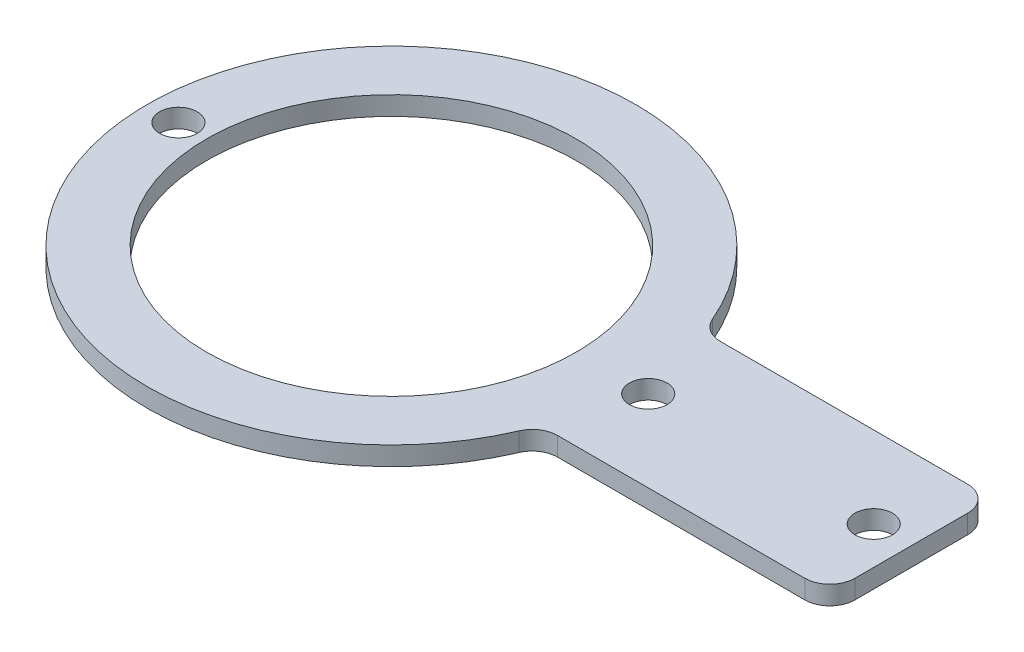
ISO-10303-21;
HEADER;
FILE_DESCRIPTION(('STEP AP214'),'2;1');
FILE_NAME('part.step','',(''),(''),'','','');
FILE_SCHEMA(('AUTOMOTIVE_DESIGN { 1 0 10303 214 1 1 1 1 }'));
ENDSEC;
DATA;
#1=APPLICATION_CONTEXT('core data for automotive mechanical design processes');
#2=APPLICATION_PROTOCOL_DEFINITION('international standard','automotive_design',2000,#1);
#3=PRODUCT_CONTEXT('',#1,'mechanical');
#4=PRODUCT('Part','Part','',(#3));
#5=PRODUCT_RELATED_PRODUCT_CATEGORY('part','',(#4));
#6=PRODUCT_DEFINITION_FORMATION('','',#4);
#7=PRODUCT_DEFINITION_CONTEXT('part definition',#1,'design');
#8=PRODUCT_DEFINITION('design','',#6,#7);
#9=PRODUCT_DEFINITION_SHAPE('','',#8);
#10=(LENGTH_UNIT() NAMED_UNIT(*) SI_UNIT(.MILLI.,.METRE.));
#11=(NAMED_UNIT(*) PLANE_ANGLE_UNIT() SI_UNIT($,.RADIAN.));
#12=(NAMED_UNIT(*) SI_UNIT($,.STERADIAN.) SOLID_ANGLE_UNIT());
#13=UNCERTAINTY_MEASURE_WITH_UNIT(LENGTH_MEASURE(1.E-05),#10,'distance_accuracy_value','');
#14=(GEOMETRIC_REPRESENTATION_CONTEXT(3) GLOBAL_UNCERTAINTY_ASSIGNED_CONTEXT((#13)) GLOBAL_UNIT_ASSIGNED_CONTEXT((#10,
#11,#12)) REPRESENTATION_CONTEXT('',''));
#15=CARTESIAN_POINT('',(0.,0.,0.));
#16=DIRECTION('',(0.,0.,1.));
#17=DIRECTION('',(1.,0.,0.));
#18=AXIS2_PLACEMENT_3D('',#15,#16,#17);
#19=CARTESIAN_POINT('',(19.7484176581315,1.5,8.5));
#20=DIRECTION('',(0.,-1.,0.));
#21=DIRECTION('',(0.,0.,-1.));
#22=AXIS2_PLACEMENT_3D('',#19,#20,#21);
#23=CYLINDRICAL_SURFACE('',#22,2.);
#24=CARTESIAN_POINT('',(19.7484176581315,0.,8.5));
#25=DIRECTION('',(0.,-1.,0.));
#26=DIRECTION('',(0.,0.,1.));
#27=AXIS2_PLACEMENT_3D('',#24,#25,#26);
#28=CIRCLE('',#27,2.);
#29=CARTESIAN_POINT('',(17.9113555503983,0.,7.7093023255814));
#30=VERTEX_POINT('',#29);
#31=CARTESIAN_POINT('',(19.7484176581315,0.,6.5));
#32=VERTEX_POINT('',#31);
#33=EDGE_CURVE('E133',#30,#32,#28,.T.);
#34=ORIENTED_EDGE('',*,*,#33,.T.);
#35=DIRECTION('',(0.,-1.,0.));
#36=VECTOR('',#35,1.);
#37=CARTESIAN_POINT('',(19.7484176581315,1.5,6.5));
#38=LINE('',#37,#36);
#39=CARTESIAN_POINT('',(19.7484176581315,1.5,6.5));
#40=VERTEX_POINT('',#39);
#41=EDGE_CURVE('E11',#40,#32,#38,.T.);
#42=ORIENTED_EDGE('',*,*,#41,.F.);
#43=CARTESIAN_POINT('',(19.7484176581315,1.5,8.5));
#44=DIRECTION('',(0.,-1.,0.));
#45=DIRECTION('',(0.,0.,1.));
#46=AXIS2_PLACEMENT_3D('',#43,#44,#45);
#47=CIRCLE('',#46,2.);
#48=CARTESIAN_POINT('',(17.9113555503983,1.5,7.7093023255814));
#49=VERTEX_POINT('',#48);
#50=EDGE_CURVE('E148',#49,#40,#47,.T.);
#51=ORIENTED_EDGE('',*,*,#50,.F.);
#52=DIRECTION('',(0.,-1.,0.));
#53=VECTOR('',#52,1.);
#54=CARTESIAN_POINT('',(17.9113555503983,1.5,7.7093023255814));
#55=LINE('',#54,#53);
#56=EDGE_CURVE('E129',#49,#30,#55,.T.);
#57=ORIENTED_EDGE('',*,*,#56,.T.);
#58=EDGE_LOOP('',(#34,#42,#51,#57));
#59=FACE_BOUND('',#58,.T.);
#60=ADVANCED_FACE('F37',(#59),#23,.F.);
#61=CARTESIAN_POINT('',(19.7484176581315,1.5,6.5));
#62=DIRECTION('',(0.,0.,-1.));
#63=DIRECTION('',(-1.,0.,0.));
#64=AXIS2_PLACEMENT_3D('',#61,#62,#63);
#65=PLANE('',#64);
#66=DIRECTION('',(1.,0.,0.));
#67=VECTOR('',#66,1.);
#68=CARTESIAN_POINT('',(19.7484176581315,0.,6.5));
#69=LINE('',#68,#67);
#70=CARTESIAN_POINT('',(39.5,0.,6.5));
#71=VERTEX_POINT('',#70);
#72=EDGE_CURVE('E136',#32,#71,#69,.T.);
#73=ORIENTED_EDGE('',*,*,#72,.T.);
#74=DIRECTION('',(0.,-1.,0.));
#75=VECTOR('',#74,1.);
#76=CARTESIAN_POINT('',(39.5,1.5,6.5));
#77=LINE('',#76,#75);
#78=CARTESIAN_POINT('',(39.5,1.5,6.5));
#79=VERTEX_POINT('',#78);
#80=EDGE_CURVE('E45',#79,#71,#77,.T.);
#81=ORIENTED_EDGE('',*,*,#80,.F.);
#82=DIRECTION('',(1.,0.,0.));
#83=VECTOR('',#82,1.);
#84=CARTESIAN_POINT('',(19.7484176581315,1.5,6.5));
#85=LINE('',#84,#83);
#86=EDGE_CURVE('E96',#40,#79,#85,.T.);
#87=ORIENTED_EDGE('',*,*,#86,.F.);
#88=ORIENTED_EDGE('',*,*,#41,.T.);
#89=EDGE_LOOP('',(#73,#81,#87,#88));
#90=FACE_BOUND('',#89,.T.);
#91=ADVANCED_FACE('F238',(#90),#65,.F.);
#92=CARTESIAN_POINT('',(39.5,1.5,4.5));
#93=DIRECTION('',(0.,-1.,0.));
#94=DIRECTION('',(0.,0.,-1.));
#95=AXIS2_PLACEMENT_3D('',#92,#93,#94);
#96=CYLINDRICAL_SURFACE('',#95,2.);
#97=CARTESIAN_POINT('',(39.5,0.,4.5));
#98=DIRECTION('',(0.,1.,0.));
#99=DIRECTION('',(0.,0.,1.));
#100=AXIS2_PLACEMENT_3D('',#97,#98,#99);
#101=CIRCLE('',#100,2.);
#102=CARTESIAN_POINT('',(41.5,0.,4.49999999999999));
#103=VERTEX_POINT('',#102);
#104=EDGE_CURVE('E139',#71,#103,#101,.T.);
#105=ORIENTED_EDGE('',*,*,#104,.T.);
#106=DIRECTION('',(0.,-1.,0.));
#107=VECTOR('',#106,1.);
#108=CARTESIAN_POINT('',(41.5,1.5,4.49999999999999));
#109=LINE('',#108,#107);
#110=CARTESIAN_POINT('',(41.5,1.5,4.49999999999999));
#111=VERTEX_POINT('',#110);
#112=EDGE_CURVE('E155',#111,#103,#109,.T.);
#113=ORIENTED_EDGE('',*,*,#112,.F.);
#114=CARTESIAN_POINT('',(39.5,1.5,4.5));
#115=DIRECTION('',(0.,1.,0.));
#116=DIRECTION('',(0.,0.,1.));
#117=AXIS2_PLACEMENT_3D('',#114,#115,#116);
#118=CIRCLE('',#117,2.);
#119=EDGE_CURVE('E163',#79,#111,#118,.T.);
#120=ORIENTED_EDGE('',*,*,#119,.F.);
#121=ORIENTED_EDGE('',*,*,#80,.T.);
#122=EDGE_LOOP('',(#105,#113,#120,#121));
#123=FACE_BOUND('',#122,.T.);
#124=ADVANCED_FACE('F161',(#123),#96,.T.);
#125=CARTESIAN_POINT('',(41.5,1.5,4.49999999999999));
#126=DIRECTION('',(-1.,0.,0.));
#127=DIRECTION('',(0.,0.,1.));
#128=AXIS2_PLACEMENT_3D('',#125,#126,#127);
#129=PLANE('',#128);
#130=DIRECTION('',(0.,0.,-1.));
#131=VECTOR('',#130,1.);
#132=CARTESIAN_POINT('',(41.5,0.,4.49999999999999));
#133=LINE('',#132,#131);
#134=CARTESIAN_POINT('',(41.5,0.,-4.49999999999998));
#135=VERTEX_POINT('',#134);
#136=EDGE_CURVE('E141',#103,#135,#133,.T.);
#137=ORIENTED_EDGE('',*,*,#136,.T.);
#138=DIRECTION('',(0.,-1.,0.));
#139=VECTOR('',#138,1.);
#140=CARTESIAN_POINT('',(41.5,1.5,-4.49999999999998));
#141=LINE('',#140,#139);
#142=CARTESIAN_POINT('',(41.5,1.5,-4.49999999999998));
#143=VERTEX_POINT('',#142);
#144=EDGE_CURVE('E152',#143,#135,#141,.T.);
#145=ORIENTED_EDGE('',*,*,#144,.F.);
#146=DIRECTION('',(0.,0.,-1.));
#147=VECTOR('',#146,1.);
#148=CARTESIAN_POINT('',(41.5,1.5,4.49999999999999));
#149=LINE('',#148,#147);
#150=EDGE_CURVE('E175',#111,#143,#149,.T.);
#151=ORIENTED_EDGE('',*,*,#150,.F.);
#152=ORIENTED_EDGE('',*,*,#112,.T.);
#153=EDGE_LOOP('',(#137,#145,#151,#152));
#154=FACE_BOUND('',#153,.T.);
#155=ADVANCED_FACE('F171',(#154),#129,.F.);
#156=CARTESIAN_POINT('',(39.5,1.5,-4.5));
#157=DIRECTION('',(0.,-1.,0.));
#158=DIRECTION('',(0.,0.,-1.));
#159=AXIS2_PLACEMENT_3D('',#156,#157,#158);
#160=CYLINDRICAL_SURFACE('',#159,2.);
#161=CARTESIAN_POINT('',(39.5,0.,-4.5));
#162=DIRECTION('',(0.,1.,0.));
#163=DIRECTION('',(0.,0.,-1.));
#164=AXIS2_PLACEMENT_3D('',#161,#162,#163);
#165=CIRCLE('',#164,2.);
#166=CARTESIAN_POINT('',(39.5,0.,-6.5));
#167=VERTEX_POINT('',#166);
#168=EDGE_CURVE('E143',#135,#167,#165,.T.);
#169=ORIENTED_EDGE('',*,*,#168,.T.);
#170=DIRECTION('',(0.,-1.,0.));
#171=VECTOR('',#170,1.);
#172=CARTESIAN_POINT('',(39.5,1.5,-6.5));
#173=LINE('',#172,#171);
#174=CARTESIAN_POINT('',(39.5,1.5,-6.5));
#175=VERTEX_POINT('',#174);
#176=EDGE_CURVE('E124',#175,#167,#173,.T.);
#177=ORIENTED_EDGE('',*,*,#176,.F.);
#178=CARTESIAN_POINT('',(39.5,1.5,-4.5));
#179=DIRECTION('',(0.,1.,0.));
#180=DIRECTION('',(0.,0.,-1.));
#181=AXIS2_PLACEMENT_3D('',#178,#179,#180);
#182=CIRCLE('',#181,2.);
#183=EDGE_CURVE('E115',#143,#175,#182,.T.);
#184=ORIENTED_EDGE('',*,*,#183,.F.);
#185=ORIENTED_EDGE('',*,*,#144,.T.);
#186=EDGE_LOOP('',(#169,#177,#184,#185));
#187=FACE_BOUND('',#186,.T.);
#188=ADVANCED_FACE('F174',(#187),#160,.T.);
#189=CARTESIAN_POINT('',(19.7484176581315,1.5,-6.5));
#190=DIRECTION('',(0.,0.,1.));
#191=DIRECTION('',(1.,0.,0.));
#192=AXIS2_PLACEMENT_3D('',#189,#190,#191);
#193=PLANE('',#192);
#194=DIRECTION('',(-1.,0.,0.));
#195=VECTOR('',#194,1.);
#196=CARTESIAN_POINT('',(19.7484176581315,0.,-6.5));
#197=LINE('',#196,#195);
#198=CARTESIAN_POINT('',(19.7484176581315,0.,-6.5));
#199=VERTEX_POINT('',#198);
#200=EDGE_CURVE('E123',#167,#199,#197,.T.);
#201=ORIENTED_EDGE('',*,*,#200,.T.);
#202=DIRECTION('',(0.,-1.,0.));
#203=VECTOR('',#202,1.);
#204=CARTESIAN_POINT('',(19.7484176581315,1.5,-6.5));
#205=LINE('',#204,#203);
#206=CARTESIAN_POINT('',(19.7484176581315,1.5,-6.5));
#207=VERTEX_POINT('',#206);
#208=EDGE_CURVE('E120',#207,#199,#205,.T.);
#209=ORIENTED_EDGE('',*,*,#208,.F.);
#210=DIRECTION('',(-1.,0.,0.));
#211=VECTOR('',#210,1.);
#212=CARTESIAN_POINT('',(19.7484176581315,1.5,-6.5));
#213=LINE('',#212,#211);
#214=EDGE_CURVE('E109',#175,#207,#213,.T.);
#215=ORIENTED_EDGE('',*,*,#214,.F.);
#216=ORIENTED_EDGE('',*,*,#176,.T.);
#217=EDGE_LOOP('',(#201,#209,#215,#216));
#218=FACE_BOUND('',#217,.T.);
#219=ADVANCED_FACE('F121',(#218),#193,.F.);
#220=CARTESIAN_POINT('',(19.7484176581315,1.5,-8.5));
#221=DIRECTION('',(0.,-1.,0.));
#222=DIRECTION('',(0.,0.,-1.));
#223=AXIS2_PLACEMENT_3D('',#220,#221,#222);
#224=CYLINDRICAL_SURFACE('',#223,2.);
#225=CARTESIAN_POINT('',(19.7484176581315,0.,-8.5));
#226=DIRECTION('',(0.,-1.,0.));
#227=DIRECTION('',(0.,0.,-1.));
#228=AXIS2_PLACEMENT_3D('',#225,#226,#227);
#229=CIRCLE('',#228,2.);
#230=CARTESIAN_POINT('',(17.9113555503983,0.,-7.70930232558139));
#231=VERTEX_POINT('',#230);
#232=EDGE_CURVE('E82',#199,#231,#229,.T.);
#233=ORIENTED_EDGE('',*,*,#232,.T.);
#234=DIRECTION('',(0.,-1.,0.));
#235=VECTOR('',#234,1.);
#236=CARTESIAN_POINT('',(17.9113555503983,1.5,-7.70930232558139));
#237=LINE('',#236,#235);
#238=CARTESIAN_POINT('',(17.9113555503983,1.5,-7.70930232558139));
#239=VERTEX_POINT('',#238);
#240=EDGE_CURVE('E125',#239,#231,#237,.T.);
#241=ORIENTED_EDGE('',*,*,#240,.F.);
#242=CARTESIAN_POINT('',(19.7484176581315,1.5,-8.5));
#243=DIRECTION('',(0.,-1.,0.));
#244=DIRECTION('',(0.,0.,-1.));
#245=AXIS2_PLACEMENT_3D('',#242,#243,#244);
#246=CIRCLE('',#245,2.);
#247=EDGE_CURVE('E113',#207,#239,#246,.T.);
#248=ORIENTED_EDGE('',*,*,#247,.F.);
#249=ORIENTED_EDGE('',*,*,#208,.T.);
#250=EDGE_LOOP('',(#233,#241,#248,#249));
#251=FACE_BOUND('',#250,.T.);
#252=ADVANCED_FACE('F127',(#251),#224,.F.);
#253=CARTESIAN_POINT('',(0.,1.5,0.));
#254=DIRECTION('',(0.,-1.,0.));
#255=DIRECTION('',(0.,0.,-1.));
#256=AXIS2_PLACEMENT_3D('',#253,#254,#255);
#257=CYLINDRICAL_SURFACE('',#256,19.5);
#258=CARTESIAN_POINT('',(0.,0.,0.));
#259=DIRECTION('',(0.,1.,0.));
#260=DIRECTION('',(0.,0.,1.));
#261=AXIS2_PLACEMENT_3D('',#258,#259,#260);
#262=CIRCLE('',#261,19.5);
#263=EDGE_CURVE('E88',#231,#30,#262,.T.);
#264=ORIENTED_EDGE('',*,*,#263,.T.);
#265=ORIENTED_EDGE('',*,*,#56,.F.);
#266=CARTESIAN_POINT('',(0.,1.5,0.));
#267=DIRECTION('',(0.,1.,0.));
#268=DIRECTION('',(0.,0.,1.));
#269=AXIS2_PLACEMENT_3D('',#266,#267,#268);
#270=CIRCLE('',#269,19.5);
#271=EDGE_CURVE('E53',#239,#49,#270,.T.);
#272=ORIENTED_EDGE('',*,*,#271,.F.);
#273=ORIENTED_EDGE('',*,*,#240,.T.);
#274=EDGE_LOOP('',(#264,#265,#272,#273));
#275=FACE_BOUND('',#274,.T.);
#276=ADVANCED_FACE('F216',(#275),#257,.T.);
#277=CARTESIAN_POINT('',(19.7484176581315,1.5,8.5));
#278=DIRECTION('',(0.,1.,0.));
#279=DIRECTION('',(0.,0.,1.));
#280=AXIS2_PLACEMENT_3D('',#277,#278,#279);
#281=PLANE('',#280);
#282=CARTESIAN_POINT('',(38.5,1.5,0.));
#283=DIRECTION('',(0.,1.,0.));
#284=DIRECTION('',(0.,0.,1.));
#285=AXIS2_PLACEMENT_3D('',#282,#283,#284);
#286=CIRCLE('',#285,1.5);
#287=CARTESIAN_POINT('',(38.5,1.5,1.5));
#288=VERTEX_POINT('',#287);
#289=EDGE_CURVE('E199',#288,#288,#286,.T.);
#290=ORIENTED_EDGE('',*,*,#289,.F.);
#291=EDGE_LOOP('',(#290));
#292=FACE_BOUND('',#291,.T.);
#293=CARTESIAN_POINT('',(20.5,1.5,0.));
#294=DIRECTION('',(0.,1.,0.));
#295=DIRECTION('',(0.,0.,1.));
#296=AXIS2_PLACEMENT_3D('',#293,#294,#295);
#297=CIRCLE('',#296,1.5);
#298=CARTESIAN_POINT('',(20.5,1.5,1.5));
#299=VERTEX_POINT('',#298);
#300=EDGE_CURVE('E193',#299,#299,#297,.T.);
#301=ORIENTED_EDGE('',*,*,#300,.F.);
#302=EDGE_LOOP('',(#301));
#303=FACE_BOUND('',#302,.T.);
#304=CARTESIAN_POINT('',(-17.,1.5,0.));
#305=DIRECTION('',(0.,1.,0.));
#306=DIRECTION('',(0.,0.,1.));
#307=AXIS2_PLACEMENT_3D('',#304,#305,#306);
#308=CIRCLE('',#307,1.5);
#309=CARTESIAN_POINT('',(-17.,1.5,1.5));
#310=VERTEX_POINT('',#309);
#311=EDGE_CURVE('E187',#310,#310,#308,.T.);
#312=ORIENTED_EDGE('',*,*,#311,.F.);
#313=EDGE_LOOP('',(#312));
#314=FACE_BOUND('',#313,.T.);
#315=CARTESIAN_POINT('',(0.,1.5,0.));
#316=DIRECTION('',(0.,1.,0.));
#317=DIRECTION('',(0.,0.,1.));
#318=AXIS2_PLACEMENT_3D('',#315,#316,#317);
#319=CIRCLE('',#318,14.75);
#320=CARTESIAN_POINT('',(0.,1.5,14.75));
#321=VERTEX_POINT('',#320);
#322=EDGE_CURVE('E181',#321,#321,#319,.T.);
#323=ORIENTED_EDGE('',*,*,#322,.F.);
#324=EDGE_LOOP('',(#323));
#325=FACE_BOUND('',#324,.T.);
#326=ORIENTED_EDGE('',*,*,#50,.T.);
#327=ORIENTED_EDGE('',*,*,#86,.T.);
#328=ORIENTED_EDGE('',*,*,#119,.T.);
#329=ORIENTED_EDGE('',*,*,#150,.T.);
#330=ORIENTED_EDGE('',*,*,#183,.T.);
#331=ORIENTED_EDGE('',*,*,#214,.T.);
#332=ORIENTED_EDGE('',*,*,#247,.T.);
#333=ORIENTED_EDGE('',*,*,#271,.T.);
#334=EDGE_LOOP('',(#326,#327,#328,#329,#330,#331,#332,#333));
#335=FACE_BOUND('',#334,.T.);
#336=ADVANCED_FACE('F111',(#292,#303,#314,#325,#335),#281,.T.);
#337=CARTESIAN_POINT('',(19.7484176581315,0.,8.5));
#338=DIRECTION('',(0.,1.,0.));
#339=DIRECTION('',(0.,0.,1.));
#340=AXIS2_PLACEMENT_3D('',#337,#338,#339);
#341=PLANE('',#340);
#342=CARTESIAN_POINT('',(38.5,0.,0.));
#343=DIRECTION('',(0.,1.,0.));
#344=DIRECTION('',(0.,0.,1.));
#345=AXIS2_PLACEMENT_3D('',#342,#343,#344);
#346=CIRCLE('',#345,1.5);
#347=CARTESIAN_POINT('',(38.5,0.,1.5));
#348=VERTEX_POINT('',#347);
#349=EDGE_CURVE('E196',#348,#348,#346,.T.);
#350=ORIENTED_EDGE('',*,*,#349,.T.);
#351=EDGE_LOOP('',(#350));
#352=FACE_BOUND('',#351,.T.);
#353=CARTESIAN_POINT('',(20.5,0.,0.));
#354=DIRECTION('',(0.,1.,0.));
#355=DIRECTION('',(0.,0.,1.));
#356=AXIS2_PLACEMENT_3D('',#353,#354,#355);
#357=CIRCLE('',#356,1.5);
#358=CARTESIAN_POINT('',(20.5,0.,1.5));
#359=VERTEX_POINT('',#358);
#360=EDGE_CURVE('E190',#359,#359,#357,.T.);
#361=ORIENTED_EDGE('',*,*,#360,.T.);
#362=EDGE_LOOP('',(#361));
#363=FACE_BOUND('',#362,.T.);
#364=CARTESIAN_POINT('',(-17.,0.,0.));
#365=DIRECTION('',(0.,1.,0.));
#366=DIRECTION('',(0.,0.,1.));
#367=AXIS2_PLACEMENT_3D('',#364,#365,#366);
#368=CIRCLE('',#367,1.5);
#369=CARTESIAN_POINT('',(-17.,0.,1.5));
#370=VERTEX_POINT('',#369);
#371=EDGE_CURVE('E184',#370,#370,#368,.T.);
#372=ORIENTED_EDGE('',*,*,#371,.T.);
#373=EDGE_LOOP('',(#372));
#374=FACE_BOUND('',#373,.T.);
#375=CARTESIAN_POINT('',(0.,0.,0.));
#376=DIRECTION('',(0.,1.,0.));
#377=DIRECTION('',(0.,0.,1.));
#378=AXIS2_PLACEMENT_3D('',#375,#376,#377);
#379=CIRCLE('',#378,14.75);
#380=CARTESIAN_POINT('',(0.,0.,14.75));
#381=VERTEX_POINT('',#380);
#382=EDGE_CURVE('E137',#381,#381,#379,.T.);
#383=ORIENTED_EDGE('',*,*,#382,.T.);
#384=EDGE_LOOP('',(#383));
#385=FACE_BOUND('',#384,.T.);
#386=ORIENTED_EDGE('',*,*,#33,.F.);
#387=ORIENTED_EDGE('',*,*,#263,.F.);
#388=ORIENTED_EDGE('',*,*,#232,.F.);
#389=ORIENTED_EDGE('',*,*,#200,.F.);
#390=ORIENTED_EDGE('',*,*,#168,.F.);
#391=ORIENTED_EDGE('',*,*,#136,.F.);
#392=ORIENTED_EDGE('',*,*,#104,.F.);
#393=ORIENTED_EDGE('',*,*,#72,.F.);
#394=EDGE_LOOP('',(#386,#387,#388,#389,#390,#391,#392,#393));
#395=FACE_BOUND('',#394,.T.);
#396=ADVANCED_FACE('F167',(#352,#363,#374,#385,#395),#341,.F.);
#397=CARTESIAN_POINT('',(0.,0.,0.));
#398=DIRECTION('',(0.,1.,0.));
#399=DIRECTION('',(0.,0.,1.));
#400=AXIS2_PLACEMENT_3D('',#397,#398,#399);
#401=CYLINDRICAL_SURFACE('',#400,14.75);
#402=ORIENTED_EDGE('',*,*,#382,.F.);
#403=EDGE_LOOP('',(#402));
#404=FACE_BOUND('',#403,.T.);
#405=ORIENTED_EDGE('',*,*,#322,.T.);
#406=EDGE_LOOP('',(#405));
#407=FACE_BOUND('',#406,.T.);
#408=ADVANCED_FACE('F224',(#404,#407),#401,.F.);
#409=CARTESIAN_POINT('',(-17.,0.,0.));
#410=DIRECTION('',(0.,1.,0.));
#411=DIRECTION('',(0.,0.,1.));
#412=AXIS2_PLACEMENT_3D('',#409,#410,#411);
#413=CYLINDRICAL_SURFACE('',#412,1.5);
#414=ORIENTED_EDGE('',*,*,#371,.F.);
#415=EDGE_LOOP('',(#414));
#416=FACE_BOUND('',#415,.T.);
#417=ORIENTED_EDGE('',*,*,#311,.T.);
#418=EDGE_LOOP('',(#417));
#419=FACE_BOUND('',#418,.T.);
#420=ADVANCED_FACE('F226',(#416,#419),#413,.F.);
#421=CARTESIAN_POINT('',(20.5,0.,0.));
#422=DIRECTION('',(0.,1.,0.));
#423=DIRECTION('',(0.,0.,1.));
#424=AXIS2_PLACEMENT_3D('',#421,#422,#423);
#425=CYLINDRICAL_SURFACE('',#424,1.5);
#426=ORIENTED_EDGE('',*,*,#360,.F.);
#427=EDGE_LOOP('',(#426));
#428=FACE_BOUND('',#427,.T.);
#429=ORIENTED_EDGE('',*,*,#300,.T.);
#430=EDGE_LOOP('',(#429));
#431=FACE_BOUND('',#430,.T.);
#432=ADVANCED_FACE('F210',(#428,#431),#425,.F.);
#433=CARTESIAN_POINT('',(38.5,0.,0.));
#434=DIRECTION('',(0.,1.,0.));
#435=DIRECTION('',(0.,0.,1.));
#436=AXIS2_PLACEMENT_3D('',#433,#434,#435);
#437=CYLINDRICAL_SURFACE('',#436,1.5);
#438=ORIENTED_EDGE('',*,*,#349,.F.);
#439=EDGE_LOOP('',(#438));
#440=FACE_BOUND('',#439,.T.);
#441=ORIENTED_EDGE('',*,*,#289,.T.);
#442=EDGE_LOOP('',(#441));
#443=FACE_BOUND('',#442,.T.);
#444=ADVANCED_FACE('F207',(#440,#443),#437,.F.);
#445=CLOSED_SHELL('',(#60,#91,#124,#155,#188,#219,#252,#276,#336,#396,#408,#420,#432,#444));
#446=MANIFOLD_SOLID_BREP('B2',#445);
#447=ADVANCED_BREP_SHAPE_REPRESENTATION('',(#18,#446),#14);
#448=SHAPE_DEFINITION_REPRESENTATION(#9,#447);
ENDSEC;
END-ISO-10303-21;
